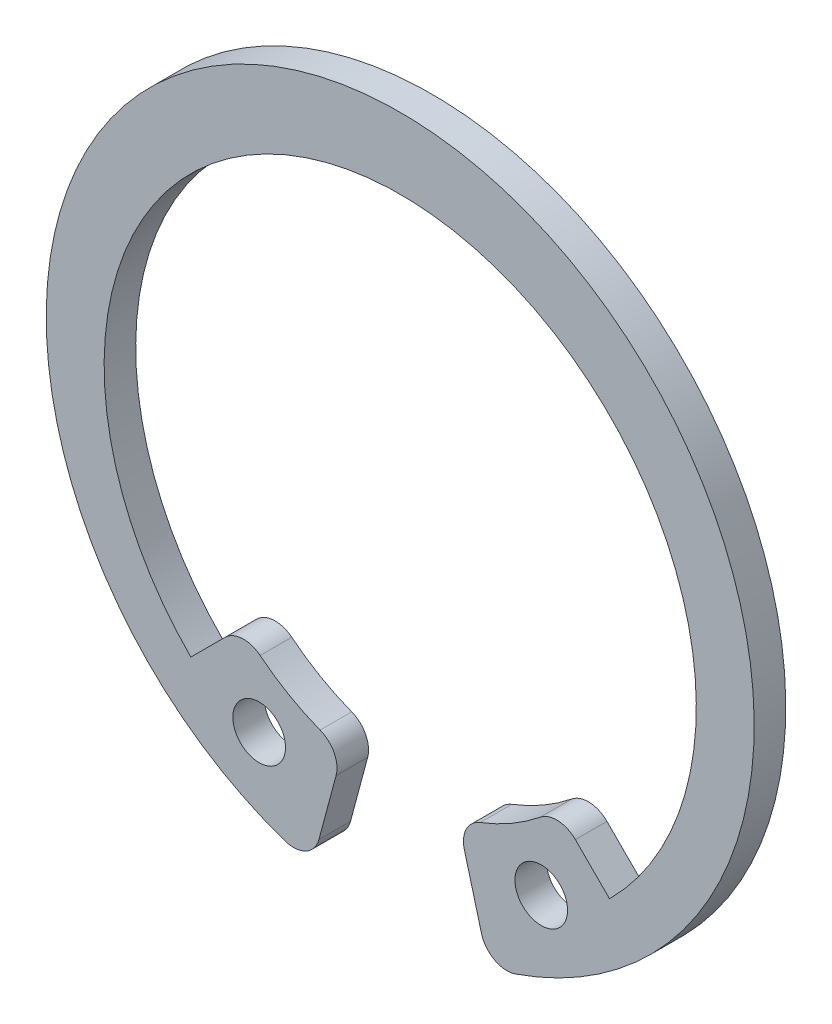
from build123d import *

# Parameters (mm, degrees)
ESQUISSE1_R          = 1
BASE_EXTRUSION_DEPTH = 1.2


with BuildPart() as part:
    # Esquisse1 → Base-Extrusion (new body)
    with BuildSketch(Plane.XY):
        with BuildLine():
            Line((3.089409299, -11.529832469), (2.436379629, -9.092692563))
            ThreePointArc((2.436379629, -9.092692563), (2.511046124, -8.380379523), (3.042897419, -7.900693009))
            ThreePointArc((3.042897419, -7.900693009), (4.233207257, -7.332130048), (5.320752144, -6.58557297))
            ThreePointArc((5.320752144, -6.58557297), (6.002098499, -6.364819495), (6.656312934, -6.656312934))
            Line((6.656312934, -6.656312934), (7.954951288, -7.954951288))
            ThreePointArc((7.954951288, -7.954951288), (0, 11.25), (-7.954951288, -7.954951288))
            Line((-7.954951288, -7.954951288), (-6.656312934, -6.656312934))
            ThreePointArc((-6.656312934, -6.656312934), (-6.002098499, -6.364819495), (-5.320752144, -6.58557297))
            ThreePointArc((-5.320752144, -6.58557297), (-4.233207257, -7.332130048), (-3.042897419, -7.900693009))
            ThreePointArc((-3.042897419, -7.900693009), (-2.511046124, -8.380379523), (-2.436379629, -9.092692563))
            Line((-2.436379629, -9.092692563), (-3.089409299, -11.529832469))
            ThreePointArc((-3.089409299, -11.529832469), (-3.585939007, -12.154001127), (-4.381064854, -12.216476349))
            ThreePointArc((-4.381064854, -12.216476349), (0, 13.95), (4.381064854, -12.216476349))
            ThreePointArc((4.381064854, -12.216476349), (3.585939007, -12.154001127), (3.089409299, -11.529832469))
        make_face()
        with Locations((-5.358922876, -9.133106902)):
            Circle(ESQUISSE1_R, mode=Mode.SUBTRACT)
        with Locations(Location((5.358922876, -9.133106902, 0), (0, 0, 180))):
            Circle(ESQUISSE1_R, mode=Mode.SUBTRACT)
    extrude(amount=BASE_EXTRUSION_DEPTH)


solid = part.part
